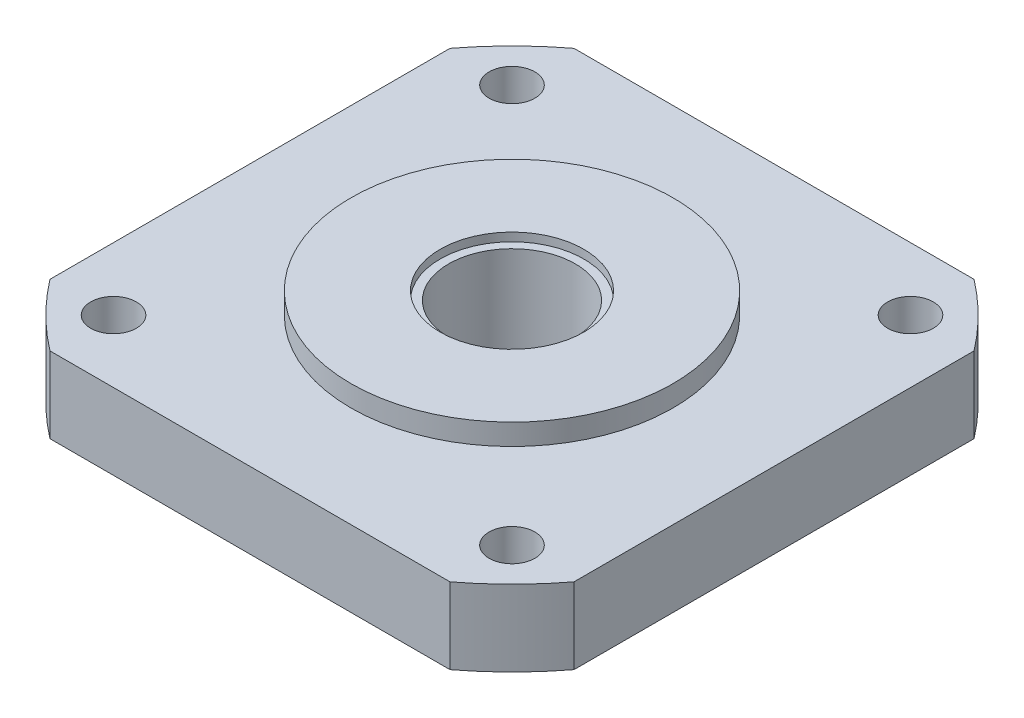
ISO-10303-21;
HEADER;
FILE_DESCRIPTION(('STEP AP214'),'2;1');
FILE_NAME('part.step','',(''),(''),'','','');
FILE_SCHEMA(('AUTOMOTIVE_DESIGN { 1 0 10303 214 1 1 1 1 }'));
ENDSEC;
DATA;
#1=APPLICATION_CONTEXT('core data for automotive mechanical design processes');
#2=APPLICATION_PROTOCOL_DEFINITION('international standard','automotive_design',2000,#1);
#3=PRODUCT_CONTEXT('',#1,'mechanical');
#4=PRODUCT('Part','Part','',(#3));
#5=PRODUCT_RELATED_PRODUCT_CATEGORY('part','',(#4));
#6=PRODUCT_DEFINITION_FORMATION('','',#4);
#7=PRODUCT_DEFINITION_CONTEXT('part definition',#1,'design');
#8=PRODUCT_DEFINITION('design','',#6,#7);
#9=PRODUCT_DEFINITION_SHAPE('','',#8);
#10=(LENGTH_UNIT() NAMED_UNIT(*) SI_UNIT(.MILLI.,.METRE.));
#11=(NAMED_UNIT(*) PLANE_ANGLE_UNIT() SI_UNIT($,.RADIAN.));
#12=(NAMED_UNIT(*) SI_UNIT($,.STERADIAN.) SOLID_ANGLE_UNIT());
#13=UNCERTAINTY_MEASURE_WITH_UNIT(LENGTH_MEASURE(1.E-05),#10,'distance_accuracy_value','');
#14=(GEOMETRIC_REPRESENTATION_CONTEXT(3) GLOBAL_UNCERTAINTY_ASSIGNED_CONTEXT((#13)) GLOBAL_UNIT_ASSIGNED_CONTEXT((#10,
#11,#12)) REPRESENTATION_CONTEXT('',''));
#15=CARTESIAN_POINT('',(0.,0.,0.));
#16=DIRECTION('',(0.,0.,1.));
#17=DIRECTION('',(1.,0.,0.));
#18=AXIS2_PLACEMENT_3D('',#15,#16,#17);
#19=CARTESIAN_POINT('',(-31.,10.,31.));
#20=DIRECTION('',(0.,1.,0.));
#21=DIRECTION('',(0.,0.,1.));
#22=AXIS2_PLACEMENT_3D('',#19,#20,#21);
#23=PLANE('',#22);
#24=CARTESIAN_POINT('',(23.5731723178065,10.,-23.5731723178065));
#25=DIRECTION('',(0.,1.,0.));
#26=DIRECTION('',(0.,0.,-1.));
#27=AXIS2_PLACEMENT_3D('',#24,#25,#26);
#28=CIRCLE('',#27,2.705);
#29=CARTESIAN_POINT('',(23.5731723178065,10.,-26.2781723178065));
#30=VERTEX_POINT('',#29);
#31=EDGE_CURVE('E145',#30,#30,#28,.T.);
#32=ORIENTED_EDGE('',*,*,#31,.F.);
#33=EDGE_LOOP('',(#32));
#34=FACE_BOUND('',#33,.T.);
#35=CARTESIAN_POINT('',(-23.5731723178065,10.,-23.5731723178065));
#36=DIRECTION('',(0.,1.,0.));
#37=DIRECTION('',(0.,0.,1.));
#38=AXIS2_PLACEMENT_3D('',#35,#36,#37);
#39=CIRCLE('',#38,2.705);
#40=CARTESIAN_POINT('',(-23.5731723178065,10.,-20.8681723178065));
#41=VERTEX_POINT('',#40);
#42=EDGE_CURVE('E135',#41,#41,#39,.T.);
#43=ORIENTED_EDGE('',*,*,#42,.F.);
#44=EDGE_LOOP('',(#43));
#45=FACE_BOUND('',#44,.T.);
#46=CARTESIAN_POINT('',(-23.5731723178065,10.,23.5731723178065));
#47=DIRECTION('',(0.,1.,0.));
#48=DIRECTION('',(0.,0.,-1.));
#49=AXIS2_PLACEMENT_3D('',#46,#47,#48);
#50=CIRCLE('',#49,2.705);
#51=CARTESIAN_POINT('',(-23.5731723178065,10.,20.8681723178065));
#52=VERTEX_POINT('',#51);
#53=EDGE_CURVE('E132',#52,#52,#50,.T.);
#54=ORIENTED_EDGE('',*,*,#53,.F.);
#55=EDGE_LOOP('',(#54));
#56=FACE_BOUND('',#55,.T.);
#57=CARTESIAN_POINT('',(23.5731723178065,10.,23.5731723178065));
#58=DIRECTION('',(0.,1.,0.));
#59=DIRECTION('',(0.,0.,1.));
#60=AXIS2_PLACEMENT_3D('',#57,#58,#59);
#61=CIRCLE('',#60,2.705);
#62=CARTESIAN_POINT('',(23.5731723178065,10.,26.2781723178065));
#63=VERTEX_POINT('',#62);
#64=EDGE_CURVE('E129',#63,#63,#61,.T.);
#65=ORIENTED_EDGE('',*,*,#64,.F.);
#66=EDGE_LOOP('',(#65));
#67=FACE_BOUND('',#66,.T.);
#68=CARTESIAN_POINT('',(0.,10.,0.));
#69=DIRECTION('',(0.,1.,0.));
#70=DIRECTION('',(0.,0.,1.));
#71=AXIS2_PLACEMENT_3D('',#68,#69,#70);
#72=CIRCLE('',#71,19.05);
#73=CARTESIAN_POINT('',(0.,10.,19.05));
#74=VERTEX_POINT('',#73);
#75=EDGE_CURVE('E167',#74,#74,#72,.T.);
#76=ORIENTED_EDGE('',*,*,#75,.F.);
#77=EDGE_LOOP('',(#76));
#78=FACE_BOUND('',#77,.T.);
#79=DIRECTION('',(1.,0.,0.));
#80=VECTOR('',#79,1.);
#81=CARTESIAN_POINT('',(-31.,10.,31.));
#82=LINE('',#81,#80);
#83=CARTESIAN_POINT('',(-23.6643191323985,10.,31.));
#84=VERTEX_POINT('',#83);
#85=CARTESIAN_POINT('',(23.6643191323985,10.,31.));
#86=VERTEX_POINT('',#85);
#87=EDGE_CURVE('E98',#84,#86,#82,.T.);
#88=ORIENTED_EDGE('',*,*,#87,.T.);
#89=CARTESIAN_POINT('',(0.,10.,0.));
#90=DIRECTION('',(0.,1.,0.));
#91=DIRECTION('',(0.,0.,1.));
#92=AXIS2_PLACEMENT_3D('',#89,#90,#91);
#93=CIRCLE('',#92,39.);
#94=CARTESIAN_POINT('',(31.,10.,23.6643191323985));
#95=VERTEX_POINT('',#94);
#96=EDGE_CURVE('E81',#86,#95,#93,.T.);
#97=ORIENTED_EDGE('',*,*,#96,.T.);
#98=DIRECTION('',(0.,0.,-1.));
#99=VECTOR('',#98,1.);
#100=CARTESIAN_POINT('',(31.,10.,-31.));
#101=LINE('',#100,#99);
#102=CARTESIAN_POINT('',(31.,10.,-23.6643191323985));
#103=VERTEX_POINT('',#102);
#104=EDGE_CURVE('E105',#95,#103,#101,.T.);
#105=ORIENTED_EDGE('',*,*,#104,.T.);
#106=CARTESIAN_POINT('',(23.6643191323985,10.,-31.));
#107=VERTEX_POINT('',#106);
#108=EDGE_CURVE('E90',#103,#107,#93,.T.);
#109=ORIENTED_EDGE('',*,*,#108,.T.);
#110=DIRECTION('',(-1.,0.,0.));
#111=VECTOR('',#110,1.);
#112=CARTESIAN_POINT('',(-31.,10.,-31.));
#113=LINE('',#112,#111);
#114=CARTESIAN_POINT('',(-23.6643191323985,10.,-31.));
#115=VERTEX_POINT('',#114);
#116=EDGE_CURVE('E108',#107,#115,#113,.T.);
#117=ORIENTED_EDGE('',*,*,#116,.T.);
#118=CARTESIAN_POINT('',(-31.,10.,-23.6643191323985));
#119=VERTEX_POINT('',#118);
#120=EDGE_CURVE('E195',#115,#119,#93,.T.);
#121=ORIENTED_EDGE('',*,*,#120,.T.);
#122=DIRECTION('',(0.,0.,1.));
#123=VECTOR('',#122,1.);
#124=CARTESIAN_POINT('',(-31.,10.,-31.));
#125=LINE('',#124,#123);
#126=CARTESIAN_POINT('',(-31.,10.,23.6643191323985));
#127=VERTEX_POINT('',#126);
#128=EDGE_CURVE('E106',#119,#127,#125,.T.);
#129=ORIENTED_EDGE('',*,*,#128,.T.);
#130=EDGE_CURVE('E92',#127,#84,#93,.T.);
#131=ORIENTED_EDGE('',*,*,#130,.T.);
#132=EDGE_LOOP('',(#88,#97,#105,#109,#117,#121,#129,#131));
#133=FACE_BOUND('',#132,.T.);
#134=ADVANCED_FACE('F16',(#34,#45,#56,#67,#78,#133),#23,.T.);
#135=CARTESIAN_POINT('',(-31.,10.,-31.));
#136=DIRECTION('',(1.,0.,0.));
#137=DIRECTION('',(0.,0.,-1.));
#138=AXIS2_PLACEMENT_3D('',#135,#136,#137);
#139=PLANE('',#138);
#140=DIRECTION('',(0.,1.,0.));
#141=VECTOR('',#140,1.);
#142=CARTESIAN_POINT('',(-31.,0.,-23.6643191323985));
#143=LINE('',#142,#141);
#144=CARTESIAN_POINT('',(-31.,1.,-23.6643191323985));
#145=VERTEX_POINT('',#144);
#146=EDGE_CURVE('E158',#145,#119,#143,.T.);
#147=ORIENTED_EDGE('',*,*,#146,.F.);
#148=DIRECTION('',(0.,0.,-1.));
#149=VECTOR('',#148,1.);
#150=CARTESIAN_POINT('',(-31.,0.999999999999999,-31.));
#151=LINE('',#150,#149);
#152=CARTESIAN_POINT('',(-31.,1.,23.6643191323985));
#153=VERTEX_POINT('',#152);
#154=EDGE_CURVE('E110',#153,#145,#151,.T.);
#155=ORIENTED_EDGE('',*,*,#154,.F.);
#156=DIRECTION('',(0.,1.,0.));
#157=VECTOR('',#156,1.);
#158=CARTESIAN_POINT('',(-31.,0.,23.6643191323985));
#159=LINE('',#158,#157);
#160=EDGE_CURVE('E162',#127,#153,#159,.F.);
#161=ORIENTED_EDGE('',*,*,#160,.F.);
#162=ORIENTED_EDGE('',*,*,#128,.F.);
#163=EDGE_LOOP('',(#147,#155,#161,#162));
#164=FACE_BOUND('',#163,.T.);
#165=ADVANCED_FACE('F18',(#164),#139,.F.);
#166=CARTESIAN_POINT('',(-31.,10.,31.));
#167=DIRECTION('',(0.,0.,-1.));
#168=DIRECTION('',(-1.,0.,0.));
#169=AXIS2_PLACEMENT_3D('',#166,#167,#168);
#170=PLANE('',#169);
#171=DIRECTION('',(0.,1.,0.));
#172=VECTOR('',#171,1.);
#173=CARTESIAN_POINT('',(-23.6643191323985,0.,31.));
#174=LINE('',#173,#172);
#175=CARTESIAN_POINT('',(-23.6643191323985,1.,31.));
#176=VERTEX_POINT('',#175);
#177=EDGE_CURVE('E160',#176,#84,#174,.T.);
#178=ORIENTED_EDGE('',*,*,#177,.F.);
#179=DIRECTION('',(-1.,0.,0.));
#180=VECTOR('',#179,1.);
#181=CARTESIAN_POINT('',(-31.,0.999999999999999,31.));
#182=LINE('',#181,#180);
#183=CARTESIAN_POINT('',(23.6643191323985,1.,31.));
#184=VERTEX_POINT('',#183);
#185=EDGE_CURVE('E100',#184,#176,#182,.T.);
#186=ORIENTED_EDGE('',*,*,#185,.F.);
#187=DIRECTION('',(0.,1.,0.));
#188=VECTOR('',#187,1.);
#189=CARTESIAN_POINT('',(23.6643191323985,0.,31.));
#190=LINE('',#189,#188);
#191=EDGE_CURVE('E34',#86,#184,#190,.F.);
#192=ORIENTED_EDGE('',*,*,#191,.F.);
#193=ORIENTED_EDGE('',*,*,#87,.F.);
#194=EDGE_LOOP('',(#178,#186,#192,#193));
#195=FACE_BOUND('',#194,.T.);
#196=ADVANCED_FACE('F97',(#195),#170,.F.);
#197=CARTESIAN_POINT('',(31.,10.,-31.));
#198=DIRECTION('',(-1.,0.,0.));
#199=DIRECTION('',(0.,0.,1.));
#200=AXIS2_PLACEMENT_3D('',#197,#198,#199);
#201=PLANE('',#200);
#202=DIRECTION('',(0.,1.,0.));
#203=VECTOR('',#202,1.);
#204=CARTESIAN_POINT('',(31.,0.,23.6643191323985));
#205=LINE('',#204,#203);
#206=CARTESIAN_POINT('',(31.,1.,23.6643191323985));
#207=VERTEX_POINT('',#206);
#208=EDGE_CURVE('E84',#207,#95,#205,.T.);
#209=ORIENTED_EDGE('',*,*,#208,.F.);
#210=DIRECTION('',(0.,0.,1.));
#211=VECTOR('',#210,1.);
#212=CARTESIAN_POINT('',(31.,0.999999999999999,-31.));
#213=LINE('',#212,#211);
#214=CARTESIAN_POINT('',(31.,1.,-23.6643191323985));
#215=VERTEX_POINT('',#214);
#216=EDGE_CURVE('E179',#215,#207,#213,.T.);
#217=ORIENTED_EDGE('',*,*,#216,.F.);
#218=DIRECTION('',(0.,1.,0.));
#219=VECTOR('',#218,1.);
#220=CARTESIAN_POINT('',(31.,0.,-23.6643191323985));
#221=LINE('',#220,#219);
#222=EDGE_CURVE('E42',#103,#215,#221,.F.);
#223=ORIENTED_EDGE('',*,*,#222,.F.);
#224=ORIENTED_EDGE('',*,*,#104,.F.);
#225=EDGE_LOOP('',(#209,#217,#223,#224));
#226=FACE_BOUND('',#225,.T.);
#227=ADVANCED_FACE('F204',(#226),#201,.F.);
#228=CARTESIAN_POINT('',(-31.,10.,-31.));
#229=DIRECTION('',(0.,0.,1.));
#230=DIRECTION('',(1.,0.,0.));
#231=AXIS2_PLACEMENT_3D('',#228,#229,#230);
#232=PLANE('',#231);
#233=DIRECTION('',(0.,1.,0.));
#234=VECTOR('',#233,1.);
#235=CARTESIAN_POINT('',(23.6643191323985,0.,-31.));
#236=LINE('',#235,#234);
#237=CARTESIAN_POINT('',(23.6643191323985,1.,-31.));
#238=VERTEX_POINT('',#237);
#239=EDGE_CURVE('E101',#238,#107,#236,.T.);
#240=ORIENTED_EDGE('',*,*,#239,.F.);
#241=DIRECTION('',(1.,0.,0.));
#242=VECTOR('',#241,1.);
#243=CARTESIAN_POINT('',(-31.,0.999999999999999,-31.));
#244=LINE('',#243,#242);
#245=CARTESIAN_POINT('',(-23.6643191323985,1.,-31.));
#246=VERTEX_POINT('',#245);
#247=EDGE_CURVE('E116',#246,#238,#244,.T.);
#248=ORIENTED_EDGE('',*,*,#247,.F.);
#249=DIRECTION('',(0.,1.,0.));
#250=VECTOR('',#249,1.);
#251=CARTESIAN_POINT('',(-23.6643191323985,0.,-31.));
#252=LINE('',#251,#250);
#253=EDGE_CURVE('E89',#115,#246,#252,.F.);
#254=ORIENTED_EDGE('',*,*,#253,.F.);
#255=ORIENTED_EDGE('',*,*,#116,.F.);
#256=EDGE_LOOP('',(#240,#248,#254,#255));
#257=FACE_BOUND('',#256,.T.);
#258=ADVANCED_FACE('F201',(#257),#232,.F.);
#259=CARTESIAN_POINT('',(0.,1.,0.));
#260=DIRECTION('',(0.,-1.,0.));
#261=DIRECTION('',(0.,0.,-1.));
#262=AXIS2_PLACEMENT_3D('',#259,#260,#261);
#263=PLANE('',#262);
#264=CARTESIAN_POINT('',(23.5731723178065,1.,-23.5731723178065));
#265=DIRECTION('',(0.,-1.,0.));
#266=DIRECTION('',(0.,0.,-1.));
#267=AXIS2_PLACEMENT_3D('',#264,#265,#266);
#268=CIRCLE('',#267,2.705);
#269=CARTESIAN_POINT('',(23.5731723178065,1.,-26.2781723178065));
#270=VERTEX_POINT('',#269);
#271=EDGE_CURVE('E20',#270,#270,#268,.T.);
#272=ORIENTED_EDGE('',*,*,#271,.F.);
#273=EDGE_LOOP('',(#272));
#274=FACE_BOUND('',#273,.T.);
#275=CARTESIAN_POINT('',(-23.5731723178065,1.,-23.5731723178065));
#276=DIRECTION('',(0.,-1.,0.));
#277=DIRECTION('',(0.,0.,-1.));
#278=AXIS2_PLACEMENT_3D('',#275,#276,#277);
#279=CIRCLE('',#278,2.705);
#280=CARTESIAN_POINT('',(-23.5731723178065,1.,-26.2781723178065));
#281=VERTEX_POINT('',#280);
#282=EDGE_CURVE('E133',#281,#281,#279,.T.);
#283=ORIENTED_EDGE('',*,*,#282,.F.);
#284=EDGE_LOOP('',(#283));
#285=FACE_BOUND('',#284,.T.);
#286=CARTESIAN_POINT('',(-23.5731723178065,1.,23.5731723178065));
#287=DIRECTION('',(0.,-1.,0.));
#288=DIRECTION('',(0.,0.,-1.));
#289=AXIS2_PLACEMENT_3D('',#286,#287,#288);
#290=CIRCLE('',#289,2.705);
#291=CARTESIAN_POINT('',(-23.5731723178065,1.,20.8681723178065));
#292=VERTEX_POINT('',#291);
#293=EDGE_CURVE('E130',#292,#292,#290,.T.);
#294=ORIENTED_EDGE('',*,*,#293,.F.);
#295=EDGE_LOOP('',(#294));
#296=FACE_BOUND('',#295,.T.);
#297=CARTESIAN_POINT('',(23.5731723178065,1.,23.5731723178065));
#298=DIRECTION('',(0.,-1.,0.));
#299=DIRECTION('',(0.,0.,-1.));
#300=AXIS2_PLACEMENT_3D('',#297,#298,#299);
#301=CIRCLE('',#300,2.705);
#302=CARTESIAN_POINT('',(23.5731723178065,1.,20.8681723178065));
#303=VERTEX_POINT('',#302);
#304=EDGE_CURVE('E126',#303,#303,#301,.T.);
#305=ORIENTED_EDGE('',*,*,#304,.F.);
#306=EDGE_LOOP('',(#305));
#307=FACE_BOUND('',#306,.T.);
#308=CARTESIAN_POINT('',(0.,1.,0.));
#309=DIRECTION('',(0.,-1.,0.));
#310=DIRECTION('',(0.,0.,-1.));
#311=AXIS2_PLACEMENT_3D('',#308,#309,#310);
#312=CIRCLE('',#311,25.);
#313=CARTESIAN_POINT('',(0.,1.,-25.));
#314=VERTEX_POINT('',#313);
#315=EDGE_CURVE('E176',#314,#314,#312,.T.);
#316=ORIENTED_EDGE('',*,*,#315,.F.);
#317=EDGE_LOOP('',(#316));
#318=FACE_BOUND('',#317,.T.);
#319=ORIENTED_EDGE('',*,*,#247,.T.);
#320=CARTESIAN_POINT('',(0.,1.,0.));
#321=DIRECTION('',(0.,-1.,0.));
#322=DIRECTION('',(0.,0.,-1.));
#323=AXIS2_PLACEMENT_3D('',#320,#321,#322);
#324=CIRCLE('',#323,39.);
#325=EDGE_CURVE('E10',#238,#215,#324,.T.);
#326=ORIENTED_EDGE('',*,*,#325,.T.);
#327=ORIENTED_EDGE('',*,*,#216,.T.);
#328=EDGE_CURVE('E25',#207,#184,#324,.T.);
#329=ORIENTED_EDGE('',*,*,#328,.T.);
#330=ORIENTED_EDGE('',*,*,#185,.T.);
#331=EDGE_CURVE('E120',#176,#153,#324,.T.);
#332=ORIENTED_EDGE('',*,*,#331,.T.);
#333=ORIENTED_EDGE('',*,*,#154,.T.);
#334=EDGE_CURVE('E27',#145,#246,#324,.T.);
#335=ORIENTED_EDGE('',*,*,#334,.T.);
#336=EDGE_LOOP('',(#319,#326,#327,#329,#330,#332,#333,#335));
#337=FACE_BOUND('',#336,.T.);
#338=ADVANCED_FACE('F186',(#274,#285,#296,#307,#318,#337),#263,.T.);
#339=CARTESIAN_POINT('',(0.,1.,0.));
#340=DIRECTION('',(0.,-1.,0.));
#341=DIRECTION('',(0.,0.,-1.));
#342=AXIS2_PLACEMENT_3D('',#339,#340,#341);
#343=CYLINDRICAL_SURFACE('',#342,25.);
#344=ORIENTED_EDGE('',*,*,#315,.T.);
#345=EDGE_LOOP('',(#344));
#346=FACE_BOUND('',#345,.T.);
#347=CARTESIAN_POINT('',(0.,0.,0.));
#348=DIRECTION('',(0.,-1.,0.));
#349=DIRECTION('',(0.,0.,-1.));
#350=AXIS2_PLACEMENT_3D('',#347,#348,#349);
#351=CIRCLE('',#350,25.);
#352=CARTESIAN_POINT('',(0.,0.,-25.));
#353=VERTEX_POINT('',#352);
#354=EDGE_CURVE('E173',#353,#353,#351,.T.);
#355=ORIENTED_EDGE('',*,*,#354,.F.);
#356=EDGE_LOOP('',(#355));
#357=FACE_BOUND('',#356,.T.);
#358=ADVANCED_FACE('F226',(#346,#357),#343,.T.);
#359=CARTESIAN_POINT('',(-31.,0.,31.));
#360=DIRECTION('',(0.,1.,0.));
#361=DIRECTION('',(0.,0.,1.));
#362=AXIS2_PLACEMENT_3D('',#359,#360,#361);
#363=PLANE('',#362);
#364=CARTESIAN_POINT('',(0.,0.,0.));
#365=DIRECTION('',(0.,1.,0.));
#366=DIRECTION('',(0.,0.,1.));
#367=AXIS2_PLACEMENT_3D('',#364,#365,#366);
#368=CIRCLE('',#367,7.50062);
#369=CARTESIAN_POINT('',(0.,0.,7.50062));
#370=VERTEX_POINT('',#369);
#371=EDGE_CURVE('E125',#370,#370,#368,.T.);
#372=ORIENTED_EDGE('',*,*,#371,.T.);
#373=EDGE_LOOP('',(#372));
#374=FACE_BOUND('',#373,.T.);
#375=ORIENTED_EDGE('',*,*,#354,.T.);
#376=EDGE_LOOP('',(#375));
#377=FACE_BOUND('',#376,.T.);
#378=ADVANCED_FACE('F222',(#374,#377),#363,.F.);
#379=CARTESIAN_POINT('',(0.,12.5,0.));
#380=DIRECTION('',(0.,-1.,0.));
#381=DIRECTION('',(0.,0.,-1.));
#382=AXIS2_PLACEMENT_3D('',#379,#380,#381);
#383=CYLINDRICAL_SURFACE('',#382,19.05);
#384=CARTESIAN_POINT('',(0.,12.5,0.));
#385=DIRECTION('',(0.,1.,0.));
#386=DIRECTION('',(0.,0.,1.));
#387=AXIS2_PLACEMENT_3D('',#384,#385,#386);
#388=CIRCLE('',#387,19.05);
#389=CARTESIAN_POINT('',(0.,12.5,19.05));
#390=VERTEX_POINT('',#389);
#391=EDGE_CURVE('E170',#390,#390,#388,.T.);
#392=ORIENTED_EDGE('',*,*,#391,.F.);
#393=EDGE_LOOP('',(#392));
#394=FACE_BOUND('',#393,.T.);
#395=ORIENTED_EDGE('',*,*,#75,.T.);
#396=EDGE_LOOP('',(#395));
#397=FACE_BOUND('',#396,.T.);
#398=ADVANCED_FACE('F225',(#394,#397),#383,.T.);
#399=CARTESIAN_POINT('',(0.,12.5,0.));
#400=DIRECTION('',(0.,1.,0.));
#401=DIRECTION('',(0.,0.,1.));
#402=AXIS2_PLACEMENT_3D('',#399,#400,#401);
#403=PLANE('',#402);
#404=CARTESIAN_POINT('',(0.,12.5,0.));
#405=DIRECTION('',(0.,1.,0.));
#406=DIRECTION('',(0.,0.,1.));
#407=AXIS2_PLACEMENT_3D('',#404,#405,#406);
#408=CIRCLE('',#407,8.5);
#409=CARTESIAN_POINT('',(0.,12.5,8.5));
#410=VERTEX_POINT('',#409);
#411=EDGE_CURVE('E124',#410,#410,#408,.T.);
#412=ORIENTED_EDGE('',*,*,#411,.F.);
#413=EDGE_LOOP('',(#412));
#414=FACE_BOUND('',#413,.T.);
#415=ORIENTED_EDGE('',*,*,#391,.T.);
#416=EDGE_LOOP('',(#415));
#417=FACE_BOUND('',#416,.T.);
#418=ADVANCED_FACE('F236',(#414,#417),#403,.T.);
#419=CARTESIAN_POINT('',(0.,0.,0.));
#420=DIRECTION('',(0.,1.,0.));
#421=DIRECTION('',(0.,0.,1.));
#422=AXIS2_PLACEMENT_3D('',#419,#420,#421);
#423=CYLINDRICAL_SURFACE('',#422,39.);
#424=ORIENTED_EDGE('',*,*,#146,.T.);
#425=ORIENTED_EDGE('',*,*,#120,.F.);
#426=ORIENTED_EDGE('',*,*,#253,.T.);
#427=ORIENTED_EDGE('',*,*,#334,.F.);
#428=EDGE_LOOP('',(#424,#425,#426,#427));
#429=FACE_BOUND('',#428,.T.);
#430=ADVANCED_FACE('F194',(#429),#423,.T.);
#431=ORIENTED_EDGE('',*,*,#160,.T.);
#432=ORIENTED_EDGE('',*,*,#331,.F.);
#433=ORIENTED_EDGE('',*,*,#177,.T.);
#434=ORIENTED_EDGE('',*,*,#130,.F.);
#435=EDGE_LOOP('',(#431,#432,#433,#434));
#436=FACE_BOUND('',#435,.T.);
#437=ADVANCED_FACE('F338',(#436),#423,.T.);
#438=ORIENTED_EDGE('',*,*,#191,.T.);
#439=ORIENTED_EDGE('',*,*,#328,.F.);
#440=ORIENTED_EDGE('',*,*,#208,.T.);
#441=ORIENTED_EDGE('',*,*,#96,.F.);
#442=EDGE_LOOP('',(#438,#439,#440,#441));
#443=FACE_BOUND('',#442,.T.);
#444=ADVANCED_FACE('F82',(#443),#423,.T.);
#445=ORIENTED_EDGE('',*,*,#222,.T.);
#446=ORIENTED_EDGE('',*,*,#325,.F.);
#447=ORIENTED_EDGE('',*,*,#239,.T.);
#448=ORIENTED_EDGE('',*,*,#108,.F.);
#449=EDGE_LOOP('',(#445,#446,#447,#448));
#450=FACE_BOUND('',#449,.T.);
#451=ADVANCED_FACE('F241',(#450),#423,.T.);
#452=CARTESIAN_POINT('',(0.,11.5,0.));
#453=DIRECTION('',(0.,1.,0.));
#454=DIRECTION('',(0.,0.,1.));
#455=AXIS2_PLACEMENT_3D('',#452,#453,#454);
#456=CYLINDRICAL_SURFACE('',#455,8.5);
#457=CARTESIAN_POINT('',(0.,11.5,0.));
#458=DIRECTION('',(0.,1.,0.));
#459=DIRECTION('',(0.,0.,1.));
#460=AXIS2_PLACEMENT_3D('',#457,#458,#459);
#461=CIRCLE('',#460,8.5);
#462=CARTESIAN_POINT('',(0.,11.5,8.5));
#463=VERTEX_POINT('',#462);
#464=EDGE_CURVE('E154',#463,#463,#461,.T.);
#465=ORIENTED_EDGE('',*,*,#464,.F.);
#466=EDGE_LOOP('',(#465));
#467=FACE_BOUND('',#466,.T.);
#468=ORIENTED_EDGE('',*,*,#411,.T.);
#469=EDGE_LOOP('',(#468));
#470=FACE_BOUND('',#469,.T.);
#471=ADVANCED_FACE('F244',(#467,#470),#456,.F.);
#472=CARTESIAN_POINT('',(0.,11.5,0.));
#473=DIRECTION('',(0.,1.,0.));
#474=DIRECTION('',(0.,0.,1.));
#475=AXIS2_PLACEMENT_3D('',#472,#473,#474);
#476=PLANE('',#475);
#477=CARTESIAN_POINT('',(0.,11.5,0.));
#478=DIRECTION('',(0.,1.,0.));
#479=DIRECTION('',(0.,0.,1.));
#480=AXIS2_PLACEMENT_3D('',#477,#478,#479);
#481=CIRCLE('',#480,7.50062);
#482=CARTESIAN_POINT('',(0.,11.5,7.50062));
#483=VERTEX_POINT('',#482);
#484=EDGE_CURVE('E121',#483,#483,#481,.T.);
#485=ORIENTED_EDGE('',*,*,#484,.F.);
#486=EDGE_LOOP('',(#485));
#487=FACE_BOUND('',#486,.T.);
#488=ORIENTED_EDGE('',*,*,#464,.T.);
#489=EDGE_LOOP('',(#488));
#490=FACE_BOUND('',#489,.T.);
#491=ADVANCED_FACE('F247',(#487,#490),#476,.T.);
#492=CARTESIAN_POINT('',(0.,0.,0.));
#493=DIRECTION('',(0.,1.,0.));
#494=DIRECTION('',(0.,0.,1.));
#495=AXIS2_PLACEMENT_3D('',#492,#493,#494);
#496=CYLINDRICAL_SURFACE('',#495,7.50062);
#497=ORIENTED_EDGE('',*,*,#484,.T.);
#498=EDGE_LOOP('',(#497));
#499=FACE_BOUND('',#498,.T.);
#500=ORIENTED_EDGE('',*,*,#371,.F.);
#501=EDGE_LOOP('',(#500));
#502=FACE_BOUND('',#501,.T.);
#503=ADVANCED_FACE('F251',(#499,#502),#496,.F.);
#504=CARTESIAN_POINT('',(23.5731723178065,0.,23.5731723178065));
#505=DIRECTION('',(0.,1.,0.));
#506=DIRECTION('',(0.,0.,1.));
#507=AXIS2_PLACEMENT_3D('',#504,#505,#506);
#508=CYLINDRICAL_SURFACE('',#507,2.705);
#509=ORIENTED_EDGE('',*,*,#304,.T.);
#510=EDGE_LOOP('',(#509));
#511=FACE_BOUND('',#510,.T.);
#512=ORIENTED_EDGE('',*,*,#64,.T.);
#513=EDGE_LOOP('',(#512));
#514=FACE_BOUND('',#513,.T.);
#515=ADVANCED_FACE('F255',(#511,#514),#508,.F.);
#516=CARTESIAN_POINT('',(-23.5731723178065,0.,23.5731723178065));
#517=DIRECTION('',(0.,1.,0.));
#518=DIRECTION('',(0.,0.,1.));
#519=AXIS2_PLACEMENT_3D('',#516,#517,#518);
#520=CYLINDRICAL_SURFACE('',#519,2.705);
#521=ORIENTED_EDGE('',*,*,#293,.T.);
#522=EDGE_LOOP('',(#521));
#523=FACE_BOUND('',#522,.T.);
#524=ORIENTED_EDGE('',*,*,#53,.T.);
#525=EDGE_LOOP('',(#524));
#526=FACE_BOUND('',#525,.T.);
#527=ADVANCED_FACE('F259',(#523,#526),#520,.F.);
#528=CARTESIAN_POINT('',(-23.5731723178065,0.,-23.5731723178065));
#529=DIRECTION('',(0.,1.,0.));
#530=DIRECTION('',(0.,0.,1.));
#531=AXIS2_PLACEMENT_3D('',#528,#529,#530);
#532=CYLINDRICAL_SURFACE('',#531,2.705);
#533=ORIENTED_EDGE('',*,*,#282,.T.);
#534=EDGE_LOOP('',(#533));
#535=FACE_BOUND('',#534,.T.);
#536=ORIENTED_EDGE('',*,*,#42,.T.);
#537=EDGE_LOOP('',(#536));
#538=FACE_BOUND('',#537,.T.);
#539=ADVANCED_FACE('F263',(#535,#538),#532,.F.);
#540=CARTESIAN_POINT('',(23.5731723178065,0.,-23.5731723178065));
#541=DIRECTION('',(0.,1.,0.));
#542=DIRECTION('',(0.,0.,1.));
#543=AXIS2_PLACEMENT_3D('',#540,#541,#542);
#544=CYLINDRICAL_SURFACE('',#543,2.705);
#545=ORIENTED_EDGE('',*,*,#271,.T.);
#546=EDGE_LOOP('',(#545));
#547=FACE_BOUND('',#546,.T.);
#548=ORIENTED_EDGE('',*,*,#31,.T.);
#549=EDGE_LOOP('',(#548));
#550=FACE_BOUND('',#549,.T.);
#551=ADVANCED_FACE('F267',(#547,#550),#544,.F.);
#552=CLOSED_SHELL('',(#134,#165,#196,#227,#258,#338,#358,#378,#398,#418,#430,#437,#444,#451,
#471,#491,#503,#515,#527,#539,#551));
#553=MANIFOLD_SOLID_BREP('B1',#552);
#554=ADVANCED_BREP_SHAPE_REPRESENTATION('',(#18,#553),#14);
#555=SHAPE_DEFINITION_REPRESENTATION(#9,#554);
ENDSEC;
END-ISO-10303-21;
